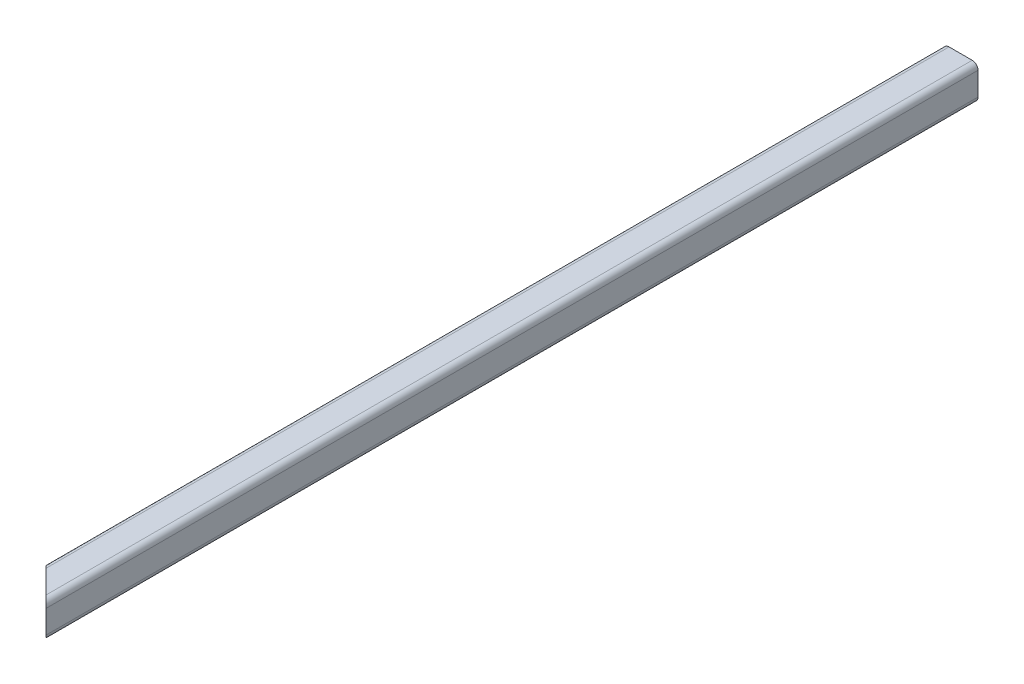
from build123d import *

# Parameters (mm, degrees)
EXTRUSION1_DEPTH = 1610
EXTRUSION5_DEPTH = 1612.396909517


with BuildPart() as part:
    # Sketch1 → Extrusion1 (new body)
    with BuildSketch(Plane.XY):
        with BuildLine():
            Line((-20, -30), (20, -30))
            ThreePointArc((20, -30), (27.071067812, -27.071067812), (30, -20))
            Line((30, -20), (30, 20))
            ThreePointArc((30, 20), (27.071067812, 27.071067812), (20, 30))
            Line((20, 30), (-20, 30))
            ThreePointArc((-20, 30), (-27.071067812, 27.071067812), (-30, 20))
            Line((-30, 20), (-30, -20))
            ThreePointArc((-30, -20), (-27.071067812, -27.071067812), (-20, -30))
        make_face()
        with BuildLine():
            Line((-20, -25), (20, -25))
            ThreePointArc((20, -25), (23.535533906, -23.535533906), (25, -20))
            Line((25, -20), (25, 20))
            ThreePointArc((25, 20), (23.535533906, 23.535533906), (20, 25))
            Line((20, 25), (-20, 25))
            ThreePointArc((-20, 25), (-23.535533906, 23.535533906), (-25, 20))
            Line((-25, 20), (-25, -20))
            ThreePointArc((-25, -20), (-23.535533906, -23.535533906), (-20, -25))
        make_face(mode=Mode.SUBTRACT)
    extrude(amount=EXTRUSION1_DEPTH)

    # Esquisse4 → Extrusion5 (cut, through all)
    with BuildSketch(Plane(origin=(0, 30, 0), x_dir=(1, 0, 0), z_dir=(0, 1, 0))):
        Polygon((30, -1610), (-30, -1610), (-30, -1550), align=None)
    extrude(amount=-EXTRUSION5_DEPTH, mode=Mode.SUBTRACT)


solid = part.part
